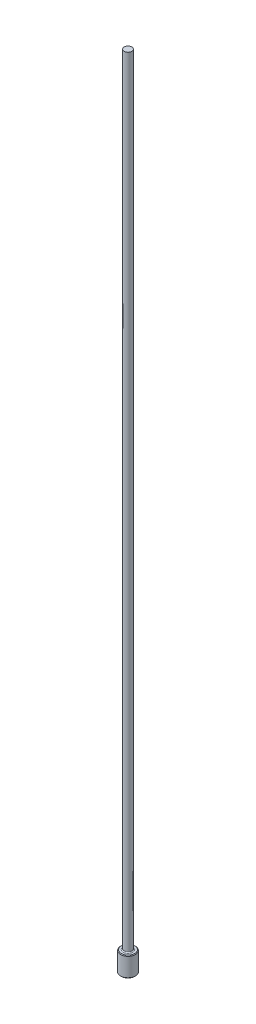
ISO-10303-21;
HEADER;
FILE_DESCRIPTION(('STEP AP214'),'2;1');
FILE_NAME('part.step','',(''),(''),'','','');
FILE_SCHEMA(('AUTOMOTIVE_DESIGN { 1 0 10303 214 1 1 1 1 }'));
ENDSEC;
DATA;
#1=APPLICATION_CONTEXT('core data for automotive mechanical design processes');
#2=APPLICATION_PROTOCOL_DEFINITION('international standard','automotive_design',2000,#1);
#3=PRODUCT_CONTEXT('',#1,'mechanical');
#4=PRODUCT('Part','Part','',(#3));
#5=PRODUCT_RELATED_PRODUCT_CATEGORY('part','',(#4));
#6=PRODUCT_DEFINITION_FORMATION('','',#4);
#7=PRODUCT_DEFINITION_CONTEXT('part definition',#1,'design');
#8=PRODUCT_DEFINITION('design','',#6,#7);
#9=PRODUCT_DEFINITION_SHAPE('','',#8);
#10=(LENGTH_UNIT() NAMED_UNIT(*) SI_UNIT(.MILLI.,.METRE.));
#11=(NAMED_UNIT(*) PLANE_ANGLE_UNIT() SI_UNIT($,.RADIAN.));
#12=(NAMED_UNIT(*) SI_UNIT($,.STERADIAN.) SOLID_ANGLE_UNIT());
#13=UNCERTAINTY_MEASURE_WITH_UNIT(LENGTH_MEASURE(1.E-05),#10,'distance_accuracy_value','');
#14=(GEOMETRIC_REPRESENTATION_CONTEXT(3) GLOBAL_UNCERTAINTY_ASSIGNED_CONTEXT((#13)) GLOBAL_UNIT_ASSIGNED_CONTEXT((#10,
#11,#12)) REPRESENTATION_CONTEXT('',''));
#15=CARTESIAN_POINT('',(0.,0.,0.));
#16=DIRECTION('',(0.,0.,1.));
#17=DIRECTION('',(1.,0.,0.));
#18=AXIS2_PLACEMENT_3D('',#15,#16,#17);
#19=CARTESIAN_POINT('',(0.,0.,0.));
#20=DIRECTION('',(0.,-1.,0.));
#21=DIRECTION('',(0.,0.,-1.));
#22=AXIS2_PLACEMENT_3D('',#19,#20,#21);
#23=PLANE('',#22);
#24=CARTESIAN_POINT('',(0.,0.,0.));
#25=DIRECTION('',(0.,-1.,0.));
#26=DIRECTION('',(0.,0.,-1.));
#27=AXIS2_PLACEMENT_3D('',#24,#25,#26);
#28=CIRCLE('',#27,0.533399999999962);
#29=CARTESIAN_POINT('',(0.,0.,-0.533399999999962));
#30=VERTEX_POINT('',#29);
#31=EDGE_CURVE('E46',#30,#30,#28,.T.);
#32=ORIENTED_EDGE('',*,*,#31,.T.);
#33=EDGE_LOOP('',(#32));
#34=FACE_BOUND('',#33,.T.);
#35=ADVANCED_FACE('F35',(#34),#23,.T.);
#36=CARTESIAN_POINT('',(0.,259.958771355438,0.));
#37=DIRECTION('',(0.,1.,0.));
#38=DIRECTION('',(0.,0.,1.));
#39=AXIS2_PLACEMENT_3D('',#36,#37,#38);
#40=CYLINDRICAL_SURFACE('',#39,0.584199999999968);
#41=CARTESIAN_POINT('',(0.,1.52399999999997,0.));
#42=DIRECTION('',(0.,1.,0.));
#43=DIRECTION('',(0.,0.,1.));
#44=AXIS2_PLACEMENT_3D('',#41,#42,#43);
#45=CIRCLE('',#44,0.584199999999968);
#46=CARTESIAN_POINT('',(0.,1.52399999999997,0.584199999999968));
#47=VERTEX_POINT('',#46);
#48=EDGE_CURVE('E50',#47,#47,#45,.F.);
#49=ORIENTED_EDGE('',*,*,#48,.T.);
#50=EDGE_LOOP('',(#49));
#51=FACE_BOUND('',#50,.T.);
#52=CARTESIAN_POINT('',(0.,0.0508000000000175,0.));
#53=DIRECTION('',(0.,-1.,0.));
#54=DIRECTION('',(0.,0.,-1.));
#55=AXIS2_PLACEMENT_3D('',#52,#53,#54);
#56=CIRCLE('',#55,0.584199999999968);
#57=CARTESIAN_POINT('',(0.,0.0508000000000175,-0.584199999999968));
#58=VERTEX_POINT('',#57);
#59=EDGE_CURVE('E55',#58,#58,#56,.F.);
#60=ORIENTED_EDGE('',*,*,#59,.T.);
#61=EDGE_LOOP('',(#60));
#62=FACE_BOUND('',#61,.T.);
#63=ADVANCED_FACE('F77',(#51,#62),#40,.T.);
#64=CARTESIAN_POINT('',(-0.584199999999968,1.5748,0.));
#65=DIRECTION('',(0.,1.,0.));
#66=DIRECTION('',(0.,0.,1.));
#67=AXIS2_PLACEMENT_3D('',#64,#65,#66);
#68=PLANE('',#67);
#69=CARTESIAN_POINT('',(0.,1.5748,0.));
#70=DIRECTION('',(0.,1.,0.));
#71=DIRECTION('',(0.,0.,1.));
#72=AXIS2_PLACEMENT_3D('',#69,#70,#71);
#73=CIRCLE('',#72,0.380999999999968);
#74=CARTESIAN_POINT('',(0.,1.5748,0.380999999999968));
#75=VERTEX_POINT('',#74);
#76=EDGE_CURVE('E10',#75,#75,#73,.F.);
#77=ORIENTED_EDGE('',*,*,#76,.T.);
#78=EDGE_LOOP('',(#77));
#79=FACE_BOUND('',#78,.T.);
#80=CARTESIAN_POINT('',(0.,1.5748,0.));
#81=DIRECTION('',(0.,1.,0.));
#82=DIRECTION('',(0.,0.,1.));
#83=AXIS2_PLACEMENT_3D('',#80,#81,#82);
#84=CIRCLE('',#83,0.533399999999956);
#85=CARTESIAN_POINT('',(0.,1.5748,0.533399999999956));
#86=VERTEX_POINT('',#85);
#87=EDGE_CURVE('E58',#86,#86,#84,.T.);
#88=ORIENTED_EDGE('',*,*,#87,.T.);
#89=EDGE_LOOP('',(#88));
#90=FACE_BOUND('',#89,.T.);
#91=ADVANCED_FACE('F69',(#79,#90),#68,.T.);
#92=CARTESIAN_POINT('',(0.,259.958771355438,0.));
#93=DIRECTION('',(0.,1.,0.));
#94=DIRECTION('',(0.,0.,1.));
#95=AXIS2_PLACEMENT_3D('',#92,#93,#94);
#96=CYLINDRICAL_SURFACE('',#95,0.304799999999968);
#97=CARTESIAN_POINT('',(0.,1.65100000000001,0.));
#98=DIRECTION('',(0.,1.,0.));
#99=DIRECTION('',(0.,0.,1.));
#100=AXIS2_PLACEMENT_3D('',#97,#98,#99);
#101=CIRCLE('',#100,0.304799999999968);
#102=CARTESIAN_POINT('',(0.,1.65100000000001,0.304799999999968));
#103=VERTEX_POINT('',#102);
#104=EDGE_CURVE('E42',#103,#103,#101,.T.);
#105=ORIENTED_EDGE('',*,*,#104,.T.);
#106=EDGE_LOOP('',(#105));
#107=FACE_BOUND('',#106,.T.);
#108=CARTESIAN_POINT('',(0.,63.5,0.));
#109=DIRECTION('',(0.,1.,0.));
#110=DIRECTION('',(0.,0.,1.));
#111=AXIS2_PLACEMENT_3D('',#108,#109,#110);
#112=CIRCLE('',#111,0.304799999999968);
#113=CARTESIAN_POINT('',(0.,63.5,0.304799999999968));
#114=VERTEX_POINT('',#113);
#115=EDGE_CURVE('E61',#114,#114,#112,.T.);
#116=ORIENTED_EDGE('',*,*,#115,.F.);
#117=EDGE_LOOP('',(#116));
#118=FACE_BOUND('',#117,.T.);
#119=ADVANCED_FACE('F67',(#107,#118),#96,.T.);
#120=CARTESIAN_POINT('',(-0.304799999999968,63.5,0.));
#121=DIRECTION('',(0.,1.,0.));
#122=DIRECTION('',(0.,0.,1.));
#123=AXIS2_PLACEMENT_3D('',#120,#121,#122);
#124=PLANE('',#123);
#125=ORIENTED_EDGE('',*,*,#115,.T.);
#126=EDGE_LOOP('',(#125));
#127=FACE_BOUND('',#126,.T.);
#128=ADVANCED_FACE('F65',(#127),#124,.T.);
#129=CARTESIAN_POINT('',(0.,1.57479999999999,0.));
#130=DIRECTION('',(0.,-1.,0.));
#131=DIRECTION('',(0.,0.,-1.));
#132=AXIS2_PLACEMENT_3D('',#129,#130,#131);
#133=CONICAL_SURFACE('',#132,0.533399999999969,0.785398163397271);
#134=ORIENTED_EDGE('',*,*,#48,.F.);
#135=EDGE_LOOP('',(#134));
#136=FACE_BOUND('',#135,.T.);
#137=ORIENTED_EDGE('',*,*,#87,.F.);
#138=EDGE_LOOP('',(#137));
#139=FACE_BOUND('',#138,.T.);
#140=ADVANCED_FACE('F75',(#136,#139),#133,.T.);
#141=CARTESIAN_POINT('',(0.,0.0508000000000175,0.));
#142=DIRECTION('',(0.,1.,0.));
#143=DIRECTION('',(0.,0.,1.));
#144=AXIS2_PLACEMENT_3D('',#141,#142,#143);
#145=CONICAL_SURFACE('',#144,0.584199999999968,0.785398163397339);
#146=ORIENTED_EDGE('',*,*,#31,.F.);
#147=EDGE_LOOP('',(#146));
#148=FACE_BOUND('',#147,.T.);
#149=ORIENTED_EDGE('',*,*,#59,.F.);
#150=EDGE_LOOP('',(#149));
#151=FACE_BOUND('',#150,.T.);
#152=ADVANCED_FACE('F89',(#148,#151),#145,.T.);
#153=CARTESIAN_POINT('',(0.,1.65100000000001,0.));
#154=DIRECTION('',(0.,1.,0.));
#155=DIRECTION('',(0.,0.,1.));
#156=AXIS2_PLACEMENT_3D('',#153,#154,#155);
#157=TOROIDAL_SURFACE('',#156,0.380999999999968,0.0762);
#158=ORIENTED_EDGE('',*,*,#76,.F.);
#159=EDGE_LOOP('',(#158));
#160=FACE_BOUND('',#159,.T.);
#161=ORIENTED_EDGE('',*,*,#104,.F.);
#162=EDGE_LOOP('',(#161));
#163=FACE_BOUND('',#162,.T.);
#164=ADVANCED_FACE('F37',(#160,#163),#157,.F.);
#165=CLOSED_SHELL('',(#35,#63,#91,#119,#128,#140,#152,#164));
#166=MANIFOLD_SOLID_BREP('B2',#165);
#167=ADVANCED_BREP_SHAPE_REPRESENTATION('',(#18,#166),#14);
#168=SHAPE_DEFINITION_REPRESENTATION(#9,#167);
ENDSEC;
END-ISO-10303-21;
